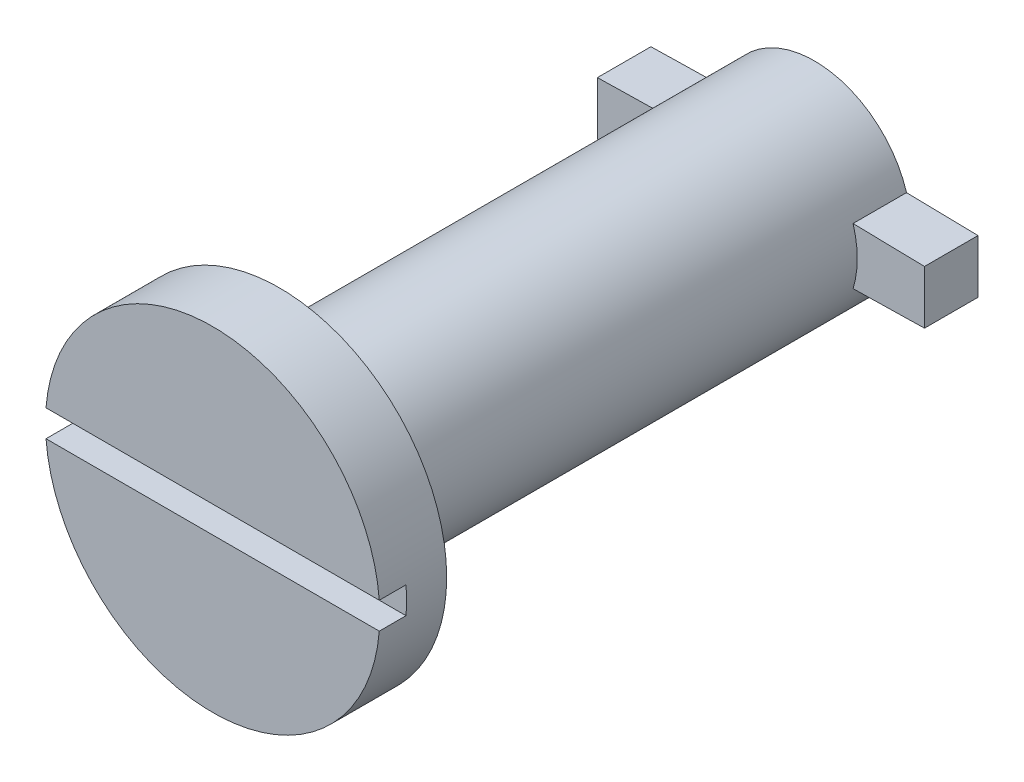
from build123d import *

# Parameters (mm, degrees)
CROQUIS1_R              = 7.2
SALIENTE_EXTRUIR1_DEPTH = 40
CROQUIS2_R              = 12.5
SALIENTE_EXTRUIR2_DEPTH = 5
CORTAR_EXTRUIR1_DEPTH   = 2
SALIENTE_EXTRUIR3_START = -4
SALIENTE_EXTRUIR3_DEPTH = 4
CROQUIS6_R              = 5.2
CORTAR_EXTRUIR3_DEPTH   = 30


with BuildPart() as part:
    # Croquis1 → Saliente-Extruir1 (new body)
    with BuildSketch(Plane.XY):
        with Locations((29.187202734, 25)):
            Circle(CROQUIS1_R)
    extrude(amount=-SALIENTE_EXTRUIR1_DEPTH)

    # Croquis2 → Saliente-Extruir2 (add)
    with BuildSketch(Plane.XY):
        with Locations((29.187202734, 25)):
            Circle(CROQUIS2_R)
    extrude(amount=SALIENTE_EXTRUIR2_DEPTH)

    # Croquis3 → Cortar-Extruir1 (cut)
    with BuildSketch(Plane.XY.offset(5)):
        Polygon((30.187202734, 26), (41.687202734, 26), (41.687202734, 24), (30.187202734, 24), (16.687202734, 24), (16.687202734, 26), align=None)
    extrude(amount=-CORTAR_EXTRUIR1_DEPTH, mode=Mode.SUBTRACT)

    # Croquis4 → Saliente-Extruir3 (add)
    with BuildSketch(Plane(origin=(0, 0, -40), x_dir=(-1, 0, 0), z_dir=(0, 0, -1)).offset(SALIENTE_EXTRUIR3_START)):
        with BuildLine():
            Line((-16.958786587, 23), (-16.958786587, 27))
            Line((-16.958786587, 27), (-22.30266492, 27.10787549))
            ThreePointArc((-22.30266492, 27.10787549), (-29.187202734, 32.2), (-36.071740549, 27.10787549))
            Line((-36.071740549, 27.10787549), (-41.415618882, 27))
            Line((-41.415618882, 27), (-41.415618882, 23))
            Line((-41.415618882, 23), (-36.071740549, 22.89212451))
            ThreePointArc((-36.071740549, 22.89212451), (-29.187202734, 17.8), (-22.30266492, 22.89212451))
            Line((-22.30266492, 22.89212451), (-16.958786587, 23))
        make_face()
    extrude(amount=SALIENTE_EXTRUIR3_DEPTH)

    # Croquis6 → Cortar-Extruir3 (cut)
    with BuildSketch(Plane(origin=(0, 0, -40), x_dir=(-1, 0, 0), z_dir=(0, 0, -1))):
        with Locations((-29.187202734, 25)):
            Circle(CROQUIS6_R)
    extrude(amount=-CORTAR_EXTRUIR3_DEPTH, mode=Mode.SUBTRACT)


solid = part.part
